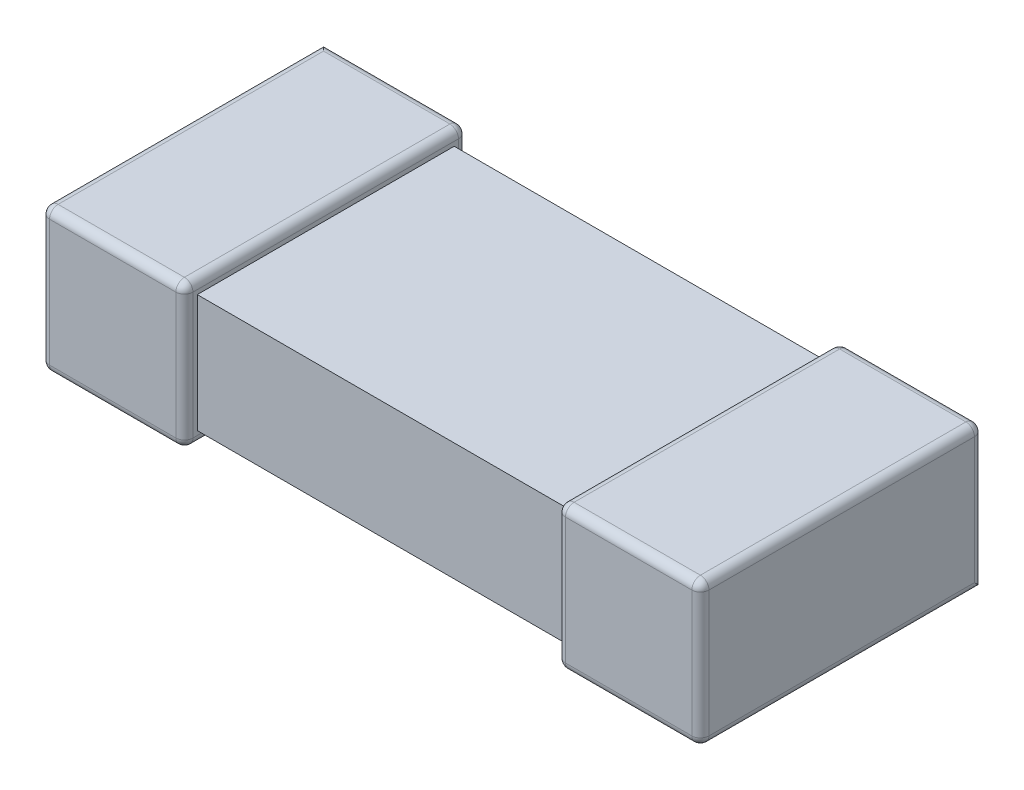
ISO-10303-21;
HEADER;
FILE_DESCRIPTION(('STEP AP214'),'2;1');
FILE_NAME('part.step','',(''),(''),'','','');
FILE_SCHEMA(('AUTOMOTIVE_DESIGN { 1 0 10303 214 1 1 1 1 }'));
ENDSEC;
DATA;
#1=APPLICATION_CONTEXT('core data for automotive mechanical design processes');
#2=APPLICATION_PROTOCOL_DEFINITION('international standard','automotive_design',2000,#1);
#3=PRODUCT_CONTEXT('',#1,'mechanical');
#4=PRODUCT('Part','Part','',(#3));
#5=PRODUCT_RELATED_PRODUCT_CATEGORY('part','',(#4));
#6=PRODUCT_DEFINITION_FORMATION('','',#4);
#7=PRODUCT_DEFINITION_CONTEXT('part definition',#1,'design');
#8=PRODUCT_DEFINITION('design','',#6,#7);
#9=PRODUCT_DEFINITION_SHAPE('','',#8);
#10=(LENGTH_UNIT() NAMED_UNIT(*) SI_UNIT(.MILLI.,.METRE.));
#11=(NAMED_UNIT(*) PLANE_ANGLE_UNIT() SI_UNIT($,.RADIAN.));
#12=(NAMED_UNIT(*) SI_UNIT($,.STERADIAN.) SOLID_ANGLE_UNIT());
#13=UNCERTAINTY_MEASURE_WITH_UNIT(LENGTH_MEASURE(1.E-05),#10,'distance_accuracy_value','');
#14=(GEOMETRIC_REPRESENTATION_CONTEXT(3) GLOBAL_UNCERTAINTY_ASSIGNED_CONTEXT((#13)) GLOBAL_UNIT_ASSIGNED_CONTEXT((#10,
#11,#12)) REPRESENTATION_CONTEXT('',''));
#15=CARTESIAN_POINT('',(0.,0.,0.));
#16=DIRECTION('',(0.,0.,1.));
#17=DIRECTION('',(1.,0.,0.));
#18=AXIS2_PLACEMENT_3D('',#15,#16,#17);
#19=CARTESIAN_POINT('',(-1.1049,0.6985,-0.762000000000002));
#20=DIRECTION('',(0.,0.,1.));
#21=DIRECTION('',(1.,0.,0.));
#22=AXIS2_PLACEMENT_3D('',#19,#20,#21);
#23=PLANE('',#22);
#24=DIRECTION('',(-1.,0.,0.));
#25=VECTOR('',#24,1.);
#26=CARTESIAN_POINT('',(-1.1049,0.,-0.762000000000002));
#27=LINE('',#26,#25);
#28=CARTESIAN_POINT('',(1.1049,0.,-0.762000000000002));
#29=VERTEX_POINT('',#28);
#30=CARTESIAN_POINT('',(-1.1049,0.,-0.762000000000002));
#31=VERTEX_POINT('',#30);
#32=EDGE_CURVE('E212',#29,#31,#27,.T.);
#33=ORIENTED_EDGE('',*,*,#32,.T.);
#34=DIRECTION('',(0.,-1.,0.));
#35=VECTOR('',#34,1.);
#36=CARTESIAN_POINT('',(-1.1049,0.6985,-0.762000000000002));
#37=LINE('',#36,#35);
#38=CARTESIAN_POINT('',(-1.1049,0.6985,-0.762000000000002));
#39=VERTEX_POINT('',#38);
#40=EDGE_CURVE('E234',#39,#31,#37,.T.);
#41=ORIENTED_EDGE('',*,*,#40,.F.);
#42=DIRECTION('',(-1.,0.,0.));
#43=VECTOR('',#42,1.);
#44=CARTESIAN_POINT('',(-1.1049,0.6985,-0.762000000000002));
#45=LINE('',#44,#43);
#46=CARTESIAN_POINT('',(1.1049,0.6985,-0.762000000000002));
#47=VERTEX_POINT('',#46);
#48=EDGE_CURVE('E976',#47,#39,#45,.T.);
#49=ORIENTED_EDGE('',*,*,#48,.F.);
#50=DIRECTION('',(0.,-1.,0.));
#51=VECTOR('',#50,1.);
#52=CARTESIAN_POINT('',(1.1049,0.6985,-0.762000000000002));
#53=LINE('',#52,#51);
#54=EDGE_CURVE('E242',#47,#29,#53,.T.);
#55=ORIENTED_EDGE('',*,*,#54,.T.);
#56=EDGE_LOOP('',(#33,#41,#49,#55));
#57=FACE_BOUND('',#56,.T.);
#58=ADVANCED_FACE('F34',(#57),#23,.F.);
#59=CARTESIAN_POINT('',(-1.1049,0.6985,0.761999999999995));
#60=DIRECTION('',(0.,0.,-1.));
#61=DIRECTION('',(-1.,0.,0.));
#62=AXIS2_PLACEMENT_3D('',#59,#60,#61);
#63=PLANE('',#62);
#64=DIRECTION('',(1.,0.,0.));
#65=VECTOR('',#64,1.);
#66=CARTESIAN_POINT('',(-1.1049,0.,0.761999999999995));
#67=LINE('',#66,#65);
#68=CARTESIAN_POINT('',(-1.1049,0.,0.761999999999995));
#69=VERTEX_POINT('',#68);
#70=CARTESIAN_POINT('',(1.1049,0.,0.761999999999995));
#71=VERTEX_POINT('',#70);
#72=EDGE_CURVE('E209',#69,#71,#67,.T.);
#73=ORIENTED_EDGE('',*,*,#72,.T.);
#74=DIRECTION('',(0.,-1.,0.));
#75=VECTOR('',#74,1.);
#76=CARTESIAN_POINT('',(1.1049,0.6985,0.761999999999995));
#77=LINE('',#76,#75);
#78=CARTESIAN_POINT('',(1.1049,0.6985,0.761999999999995));
#79=VERTEX_POINT('',#78);
#80=EDGE_CURVE('E223',#79,#71,#77,.T.);
#81=ORIENTED_EDGE('',*,*,#80,.F.);
#82=DIRECTION('',(1.,0.,0.));
#83=VECTOR('',#82,1.);
#84=CARTESIAN_POINT('',(-1.1049,0.6985,0.761999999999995));
#85=LINE('',#84,#83);
#86=CARTESIAN_POINT('',(-1.1049,0.6985,0.761999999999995));
#87=VERTEX_POINT('',#86);
#88=EDGE_CURVE('E232',#87,#79,#85,.T.);
#89=ORIENTED_EDGE('',*,*,#88,.F.);
#90=DIRECTION('',(0.,-1.,0.));
#91=VECTOR('',#90,1.);
#92=CARTESIAN_POINT('',(-1.1049,0.6985,0.761999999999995));
#93=LINE('',#92,#91);
#94=EDGE_CURVE('E226',#87,#69,#93,.T.);
#95=ORIENTED_EDGE('',*,*,#94,.T.);
#96=EDGE_LOOP('',(#73,#81,#89,#95));
#97=FACE_BOUND('',#96,.T.);
#98=ADVANCED_FACE('F221',(#97),#63,.F.);
#99=CARTESIAN_POINT('',(0.,0.6985,0.));
#100=DIRECTION('',(0.,1.,0.));
#101=DIRECTION('',(0.,0.,1.));
#102=AXIS2_PLACEMENT_3D('',#99,#100,#101);
#103=PLANE('',#102);
#104=DIRECTION('',(0.,0.,-1.));
#105=VECTOR('',#104,1.);
#106=CARTESIAN_POINT('',(1.1049,0.6985,-0.762000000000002));
#107=LINE('',#106,#105);
#108=EDGE_CURVE('E227',#79,#47,#107,.T.);
#109=ORIENTED_EDGE('',*,*,#108,.T.);
#110=ORIENTED_EDGE('',*,*,#48,.T.);
#111=DIRECTION('',(0.,0.,1.));
#112=VECTOR('',#111,1.);
#113=CARTESIAN_POINT('',(-1.1049,0.6985,-0.762000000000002));
#114=LINE('',#113,#112);
#115=EDGE_CURVE('E236',#39,#87,#114,.T.);
#116=ORIENTED_EDGE('',*,*,#115,.T.);
#117=ORIENTED_EDGE('',*,*,#88,.T.);
#118=EDGE_LOOP('',(#109,#110,#116,#117));
#119=FACE_BOUND('',#118,.T.);
#120=ADVANCED_FACE('F535',(#119),#103,.T.);
#121=CARTESIAN_POINT('',(0.,0.,0.));
#122=DIRECTION('',(0.,1.,0.));
#123=DIRECTION('',(0.,0.,1.));
#124=AXIS2_PLACEMENT_3D('',#121,#122,#123);
#125=PLANE('',#124);
#126=DIRECTION('',(0.,0.,-1.));
#127=VECTOR('',#126,1.);
#128=CARTESIAN_POINT('',(1.1049,0.,-0.762000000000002));
#129=LINE('',#128,#127);
#130=EDGE_CURVE('E206',#71,#29,#129,.T.);
#131=ORIENTED_EDGE('',*,*,#130,.F.);
#132=ORIENTED_EDGE('',*,*,#72,.F.);
#133=DIRECTION('',(0.,0.,1.));
#134=VECTOR('',#133,1.);
#135=CARTESIAN_POINT('',(-1.1049,0.,-0.762000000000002));
#136=LINE('',#135,#134);
#137=EDGE_CURVE('E228',#31,#69,#136,.T.);
#138=ORIENTED_EDGE('',*,*,#137,.F.);
#139=ORIENTED_EDGE('',*,*,#32,.F.);
#140=EDGE_LOOP('',(#131,#132,#138,#139));
#141=FACE_BOUND('',#140,.T.);
#142=ADVANCED_FACE('F208',(#141),#125,.F.);
#143=CARTESIAN_POINT('',(-1.9558,-0.0762000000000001,0.838199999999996));
#144=DIRECTION('',(0.,0.,-1.));
#145=DIRECTION('',(-1.,0.,0.));
#146=AXIS2_PLACEMENT_3D('',#143,#144,#145);
#147=PLANE('',#146);
#148=DIRECTION('',(0.,1.,0.));
#149=VECTOR('',#148,1.);
#150=CARTESIAN_POINT('',(-1.905,-0.0762000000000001,0.838199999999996));
#151=LINE('',#150,#149);
#152=CARTESIAN_POINT('',(-1.905,0.7239,0.838199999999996));
#153=VERTEX_POINT('',#152);
#154=CARTESIAN_POINT('',(-1.905,-0.0254000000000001,0.838199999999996));
#155=VERTEX_POINT('',#154);
#156=EDGE_CURVE('E271',#153,#155,#151,.F.);
#157=ORIENTED_EDGE('',*,*,#156,.T.);
#158=DIRECTION('',(1.,0.,0.));
#159=VECTOR('',#158,1.);
#160=CARTESIAN_POINT('',(-1.9558,-0.0254000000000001,0.838199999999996));
#161=LINE('',#160,#159);
#162=CARTESIAN_POINT('',(-1.1557,-0.0254000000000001,0.838199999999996));
#163=VERTEX_POINT('',#162);
#164=EDGE_CURVE('E276',#155,#163,#161,.T.);
#165=ORIENTED_EDGE('',*,*,#164,.T.);
#166=DIRECTION('',(0.,1.,0.));
#167=VECTOR('',#166,1.);
#168=CARTESIAN_POINT('',(-1.1557,0.7747,0.838199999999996));
#169=LINE('',#168,#167);
#170=CARTESIAN_POINT('',(-1.1557,0.7239,0.838199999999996));
#171=VERTEX_POINT('',#170);
#172=EDGE_CURVE('E273',#163,#171,#169,.T.);
#173=ORIENTED_EDGE('',*,*,#172,.T.);
#174=DIRECTION('',(1.,0.,0.));
#175=VECTOR('',#174,1.);
#176=CARTESIAN_POINT('',(-1.9558,0.7239,0.838199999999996));
#177=LINE('',#176,#175);
#178=EDGE_CURVE('E269',#171,#153,#177,.F.);
#179=ORIENTED_EDGE('',*,*,#178,.T.);
#180=EDGE_LOOP('',(#157,#165,#173,#179));
#181=FACE_BOUND('',#180,.T.);
#182=ADVANCED_FACE('F668',(#181),#147,.F.);
#183=CARTESIAN_POINT('',(-1.9558,0.7747,-0.838200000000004));
#184=DIRECTION('',(0.,-1.,0.));
#185=DIRECTION('',(0.,0.,-1.));
#186=AXIS2_PLACEMENT_3D('',#183,#184,#185);
#187=PLANE('',#186);
#188=DIRECTION('',(1.,0.,0.));
#189=VECTOR('',#188,1.);
#190=CARTESIAN_POINT('',(-1.9558,0.7747,0.787399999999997));
#191=LINE('',#190,#189);
#192=CARTESIAN_POINT('',(-1.905,0.7747,0.787399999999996));
#193=VERTEX_POINT('',#192);
#194=CARTESIAN_POINT('',(-1.1557,0.7747,0.787399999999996));
#195=VERTEX_POINT('',#194);
#196=EDGE_CURVE('E278',#193,#195,#191,.T.);
#197=ORIENTED_EDGE('',*,*,#196,.T.);
#198=DIRECTION('',(0.,0.,-1.));
#199=VECTOR('',#198,1.);
#200=CARTESIAN_POINT('',(-1.1557,0.7747,-0.838200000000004));
#201=LINE('',#200,#199);
#202=CARTESIAN_POINT('',(-1.1557,0.7747,-0.787400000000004));
#203=VERTEX_POINT('',#202);
#204=EDGE_CURVE('E284',#195,#203,#201,.T.);
#205=ORIENTED_EDGE('',*,*,#204,.T.);
#206=DIRECTION('',(1.,0.,0.));
#207=VECTOR('',#206,1.);
#208=CARTESIAN_POINT('',(-1.9558,0.7747,-0.787400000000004));
#209=LINE('',#208,#207);
#210=CARTESIAN_POINT('',(-1.905,0.7747,-0.787400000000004));
#211=VERTEX_POINT('',#210);
#212=EDGE_CURVE('E282',#203,#211,#209,.F.);
#213=ORIENTED_EDGE('',*,*,#212,.T.);
#214=DIRECTION('',(0.,0.,-1.));
#215=VECTOR('',#214,1.);
#216=CARTESIAN_POINT('',(-1.905,0.7747,-0.838200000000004));
#217=LINE('',#216,#215);
#218=EDGE_CURVE('E280',#211,#193,#217,.F.);
#219=ORIENTED_EDGE('',*,*,#218,.T.);
#220=EDGE_LOOP('',(#197,#205,#213,#219));
#221=FACE_BOUND('',#220,.T.);
#222=ADVANCED_FACE('F664',(#221),#187,.F.);
#223=CARTESIAN_POINT('',(-1.9558,-0.0762000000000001,-0.838200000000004));
#224=DIRECTION('',(0.,0.,1.));
#225=DIRECTION('',(1.,0.,0.));
#226=AXIS2_PLACEMENT_3D('',#223,#224,#225);
#227=PLANE('',#226);
#228=DIRECTION('',(0.,-1.,0.));
#229=VECTOR('',#228,1.);
#230=CARTESIAN_POINT('',(-1.1557,-0.0762000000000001,-0.838200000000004));
#231=LINE('',#230,#229);
#232=CARTESIAN_POINT('',(-1.1557,0.7239,-0.838200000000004));
#233=VERTEX_POINT('',#232);
#234=CARTESIAN_POINT('',(-1.1557,-0.0254000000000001,-0.838200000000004));
#235=VERTEX_POINT('',#234);
#236=EDGE_CURVE('E246',#233,#235,#231,.T.);
#237=ORIENTED_EDGE('',*,*,#236,.T.);
#238=DIRECTION('',(1.,0.,0.));
#239=VECTOR('',#238,1.);
#240=CARTESIAN_POINT('',(-1.9558,-0.0254000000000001,-0.838200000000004));
#241=LINE('',#240,#239);
#242=CARTESIAN_POINT('',(-1.9558,-0.0254000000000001,-0.838200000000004));
#243=VERTEX_POINT('',#242);
#244=EDGE_CURVE('E249',#235,#243,#241,.F.);
#245=ORIENTED_EDGE('',*,*,#244,.T.);
#246=DIRECTION('',(0.,-1.,0.));
#247=VECTOR('',#246,1.);
#248=CARTESIAN_POINT('',(-1.9558,-0.0762000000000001,-0.838200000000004));
#249=LINE('',#248,#247);
#250=CARTESIAN_POINT('',(-1.9558,0.7239,-0.838200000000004));
#251=VERTEX_POINT('',#250);
#252=EDGE_CURVE('E217',#251,#243,#249,.T.);
#253=ORIENTED_EDGE('',*,*,#252,.F.);
#254=DIRECTION('',(1.,0.,0.));
#255=VECTOR('',#254,1.);
#256=CARTESIAN_POINT('',(-1.9558,0.7239,-0.838200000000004));
#257=LINE('',#256,#255);
#258=EDGE_CURVE('E244',#251,#233,#257,.T.);
#259=ORIENTED_EDGE('',*,*,#258,.T.);
#260=EDGE_LOOP('',(#237,#245,#253,#259));
#261=FACE_BOUND('',#260,.T.);
#262=ADVANCED_FACE('F660',(#261),#227,.F.);
#263=CARTESIAN_POINT('',(-1.9558,-0.0762000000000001,-0.838200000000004));
#264=DIRECTION('',(0.,1.,0.));
#265=DIRECTION('',(0.,0.,1.));
#266=AXIS2_PLACEMENT_3D('',#263,#264,#265);
#267=PLANE('',#266);
#268=DIRECTION('',(0.,0.,1.));
#269=VECTOR('',#268,1.);
#270=CARTESIAN_POINT('',(-1.905,-0.0762000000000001,-0.838200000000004));
#271=LINE('',#270,#269);
#272=CARTESIAN_POINT('',(-1.905,-0.0762000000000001,0.787399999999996));
#273=VERTEX_POINT('',#272);
#274=CARTESIAN_POINT('',(-1.905,-0.0762000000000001,-0.787400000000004));
#275=VERTEX_POINT('',#274);
#276=EDGE_CURVE('E262',#273,#275,#271,.F.);
#277=ORIENTED_EDGE('',*,*,#276,.T.);
#278=DIRECTION('',(1.,0.,0.));
#279=VECTOR('',#278,1.);
#280=CARTESIAN_POINT('',(-1.9558,-0.0762000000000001,-0.787400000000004));
#281=LINE('',#280,#279);
#282=CARTESIAN_POINT('',(-1.1557,-0.0762000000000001,-0.787400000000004));
#283=VERTEX_POINT('',#282);
#284=EDGE_CURVE('E267',#275,#283,#281,.T.);
#285=ORIENTED_EDGE('',*,*,#284,.T.);
#286=DIRECTION('',(0.,0.,1.));
#287=VECTOR('',#286,1.);
#288=CARTESIAN_POINT('',(-1.1557,-0.0762000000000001,0.838199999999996));
#289=LINE('',#288,#287);
#290=CARTESIAN_POINT('',(-1.1557,-0.0762000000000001,0.787399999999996));
#291=VERTEX_POINT('',#290);
#292=EDGE_CURVE('E264',#283,#291,#289,.T.);
#293=ORIENTED_EDGE('',*,*,#292,.T.);
#294=DIRECTION('',(1.,0.,0.));
#295=VECTOR('',#294,1.);
#296=CARTESIAN_POINT('',(-1.9558,-0.0762000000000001,0.787399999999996));
#297=LINE('',#296,#295);
#298=EDGE_CURVE('E260',#291,#273,#297,.F.);
#299=ORIENTED_EDGE('',*,*,#298,.T.);
#300=EDGE_LOOP('',(#277,#285,#293,#299));
#301=FACE_BOUND('',#300,.T.);
#302=ADVANCED_FACE('F653',(#301),#267,.F.);
#303=CARTESIAN_POINT('',(-1.9558,0.,0.));
#304=DIRECTION('',(1.,0.,0.));
#305=DIRECTION('',(0.,0.,-1.));
#306=AXIS2_PLACEMENT_3D('',#303,#304,#305);
#307=PLANE('',#306);
#308=ORIENTED_EDGE('',*,*,#252,.T.);
#309=DIRECTION('',(0.,0.,1.));
#310=VECTOR('',#309,1.);
#311=CARTESIAN_POINT('',(-1.9558,-0.0254000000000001,0.));
#312=LINE('',#311,#310);
#313=CARTESIAN_POINT('',(-1.9558,-0.0254000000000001,0.787399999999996));
#314=VERTEX_POINT('',#313);
#315=EDGE_CURVE('E291',#243,#314,#312,.T.);
#316=ORIENTED_EDGE('',*,*,#315,.T.);
#317=DIRECTION('',(0.,1.,0.));
#318=VECTOR('',#317,1.);
#319=CARTESIAN_POINT('',(-1.9558,0.,0.787399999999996));
#320=LINE('',#319,#318);
#321=CARTESIAN_POINT('',(-1.9558,0.7239,0.787399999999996));
#322=VERTEX_POINT('',#321);
#323=EDGE_CURVE('E287',#314,#322,#320,.T.);
#324=ORIENTED_EDGE('',*,*,#323,.T.);
#325=DIRECTION('',(0.,0.,-1.));
#326=VECTOR('',#325,1.);
#327=CARTESIAN_POINT('',(-1.9558,0.7239,0.));
#328=LINE('',#327,#326);
#329=EDGE_CURVE('E289',#322,#251,#328,.T.);
#330=ORIENTED_EDGE('',*,*,#329,.T.);
#331=EDGE_LOOP('',(#308,#316,#324,#330));
#332=FACE_BOUND('',#331,.T.);
#333=ADVANCED_FACE('F650',(#332),#307,.F.);
#334=CARTESIAN_POINT('',(-1.1049,0.,0.));
#335=DIRECTION('',(1.,0.,0.));
#336=DIRECTION('',(0.,0.,-1.));
#337=AXIS2_PLACEMENT_3D('',#334,#335,#336);
#338=PLANE('',#337);
#339=DIRECTION('',(0.,0.,1.));
#340=VECTOR('',#339,1.);
#341=CARTESIAN_POINT('',(-1.1049,-0.0254000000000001,-0.838200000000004));
#342=LINE('',#341,#340);
#343=CARTESIAN_POINT('',(-1.1049,-0.0254000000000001,0.787399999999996));
#344=VERTEX_POINT('',#343);
#345=CARTESIAN_POINT('',(-1.1049,-0.0254000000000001,-0.787400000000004));
#346=VERTEX_POINT('',#345);
#347=EDGE_CURVE('E255',#344,#346,#342,.F.);
#348=ORIENTED_EDGE('',*,*,#347,.T.);
#349=DIRECTION('',(0.,-1.,0.));
#350=VECTOR('',#349,1.);
#351=CARTESIAN_POINT('',(-1.1049,0.7747,-0.787400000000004));
#352=LINE('',#351,#350);
#353=CARTESIAN_POINT('',(-1.1049,0.7239,-0.787400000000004));
#354=VERTEX_POINT('',#353);
#355=EDGE_CURVE('E257',#346,#354,#352,.F.);
#356=ORIENTED_EDGE('',*,*,#355,.T.);
#357=DIRECTION('',(0.,0.,-1.));
#358=VECTOR('',#357,1.);
#359=CARTESIAN_POINT('',(-1.1049,0.7239,0.838199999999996));
#360=LINE('',#359,#358);
#361=CARTESIAN_POINT('',(-1.1049,0.7239,0.787399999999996));
#362=VERTEX_POINT('',#361);
#363=EDGE_CURVE('E251',#354,#362,#360,.F.);
#364=ORIENTED_EDGE('',*,*,#363,.T.);
#365=DIRECTION('',(0.,1.,0.));
#366=VECTOR('',#365,1.);
#367=CARTESIAN_POINT('',(-1.1049,-0.0762000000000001,0.787399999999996));
#368=LINE('',#367,#366);
#369=EDGE_CURVE('E253',#362,#344,#368,.F.);
#370=ORIENTED_EDGE('',*,*,#369,.T.);
#371=EDGE_LOOP('',(#348,#356,#364,#370));
#372=FACE_BOUND('',#371,.T.);
#373=ORIENTED_EDGE('',*,*,#40,.T.);
#374=ORIENTED_EDGE('',*,*,#137,.T.);
#375=ORIENTED_EDGE('',*,*,#94,.F.);
#376=ORIENTED_EDGE('',*,*,#115,.F.);
#377=EDGE_LOOP('',(#373,#374,#375,#376));
#378=FACE_BOUND('',#377,.T.);
#379=ADVANCED_FACE('F649',(#372,#378),#338,.T.);
#380=CARTESIAN_POINT('',(1.9558,-0.0761999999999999,-0.838200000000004));
#381=DIRECTION('',(0.,0.,1.));
#382=DIRECTION('',(1.,0.,0.));
#383=AXIS2_PLACEMENT_3D('',#380,#381,#382);
#384=PLANE('',#383);
#385=DIRECTION('',(-1.,0.,0.));
#386=VECTOR('',#385,1.);
#387=CARTESIAN_POINT('',(1.9558,0.7239,-0.838200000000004));
#388=LINE('',#387,#386);
#389=CARTESIAN_POINT('',(1.1557,0.7239,-0.838200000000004));
#390=VERTEX_POINT('',#389);
#391=CARTESIAN_POINT('',(1.905,0.7239,-0.838200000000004));
#392=VERTEX_POINT('',#391);
#393=EDGE_CURVE('E365',#390,#392,#388,.F.);
#394=ORIENTED_EDGE('',*,*,#393,.T.);
#395=DIRECTION('',(0.,1.,0.));
#396=VECTOR('',#395,1.);
#397=CARTESIAN_POINT('',(1.905,-0.0761999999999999,-0.838200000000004));
#398=LINE('',#397,#396);
#399=CARTESIAN_POINT('',(1.905,-0.0761999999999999,-0.838200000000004));
#400=VERTEX_POINT('',#399);
#401=EDGE_CURVE('E369',#392,#400,#398,.F.);
#402=ORIENTED_EDGE('',*,*,#401,.T.);
#403=DIRECTION('',(-1.,0.,0.));
#404=VECTOR('',#403,1.);
#405=CARTESIAN_POINT('',(1.9558,-0.0761999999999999,-0.838200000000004));
#406=LINE('',#405,#404);
#407=CARTESIAN_POINT('',(1.1557,-0.0761999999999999,-0.838200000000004));
#408=VERTEX_POINT('',#407);
#409=EDGE_CURVE('E349',#400,#408,#406,.T.);
#410=ORIENTED_EDGE('',*,*,#409,.T.);
#411=DIRECTION('',(0.,1.,0.));
#412=VECTOR('',#411,1.);
#413=CARTESIAN_POINT('',(1.1557,0.7747,-0.838200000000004));
#414=LINE('',#413,#412);
#415=EDGE_CURVE('E367',#408,#390,#414,.T.);
#416=ORIENTED_EDGE('',*,*,#415,.T.);
#417=EDGE_LOOP('',(#394,#402,#410,#416));
#418=FACE_BOUND('',#417,.T.);
#419=ADVANCED_FACE('F487',(#418),#384,.F.);
#420=CARTESIAN_POINT('',(1.9558,0.7747,0.838199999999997));
#421=DIRECTION('',(0.,-1.,0.));
#422=DIRECTION('',(0.,0.,-1.));
#423=AXIS2_PLACEMENT_3D('',#420,#421,#422);
#424=PLANE('',#423);
#425=DIRECTION('',(0.,0.,1.));
#426=VECTOR('',#425,1.);
#427=CARTESIAN_POINT('',(1.905,0.7747,0.838199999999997));
#428=LINE('',#427,#426);
#429=CARTESIAN_POINT('',(1.905,0.7747,0.787399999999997));
#430=VERTEX_POINT('',#429);
#431=CARTESIAN_POINT('',(1.905,0.7747,-0.787400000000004));
#432=VERTEX_POINT('',#431);
#433=EDGE_CURVE('E384',#430,#432,#428,.F.);
#434=ORIENTED_EDGE('',*,*,#433,.T.);
#435=DIRECTION('',(-1.,0.,0.));
#436=VECTOR('',#435,1.);
#437=CARTESIAN_POINT('',(1.9558,0.7747,-0.787400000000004));
#438=LINE('',#437,#436);
#439=CARTESIAN_POINT('',(1.1557,0.7747,-0.787400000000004));
#440=VERTEX_POINT('',#439);
#441=EDGE_CURVE('E386',#432,#440,#438,.T.);
#442=ORIENTED_EDGE('',*,*,#441,.T.);
#443=DIRECTION('',(0.,0.,1.));
#444=VECTOR('',#443,1.);
#445=CARTESIAN_POINT('',(1.1557,0.7747,0.838199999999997));
#446=LINE('',#445,#444);
#447=CARTESIAN_POINT('',(1.1557,0.7747,0.787399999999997));
#448=VERTEX_POINT('',#447);
#449=EDGE_CURVE('E380',#440,#448,#446,.T.);
#450=ORIENTED_EDGE('',*,*,#449,.T.);
#451=DIRECTION('',(-1.,0.,0.));
#452=VECTOR('',#451,1.);
#453=CARTESIAN_POINT('',(1.9558,0.7747,0.787399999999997));
#454=LINE('',#453,#452);
#455=EDGE_CURVE('E382',#448,#430,#454,.F.);
#456=ORIENTED_EDGE('',*,*,#455,.T.);
#457=EDGE_LOOP('',(#434,#442,#450,#456));
#458=FACE_BOUND('',#457,.T.);
#459=ADVANCED_FACE('F464',(#458),#424,.F.);
#460=CARTESIAN_POINT('',(1.9558,-0.0761999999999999,0.838199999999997));
#461=DIRECTION('',(0.,0.,-1.));
#462=DIRECTION('',(-1.,0.,0.));
#463=AXIS2_PLACEMENT_3D('',#460,#461,#462);
#464=PLANE('',#463);
#465=DIRECTION('',(0.,-1.,0.));
#466=VECTOR('',#465,1.);
#467=CARTESIAN_POINT('',(1.905,-0.0761999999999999,0.838199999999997));
#468=LINE('',#467,#466);
#469=CARTESIAN_POINT('',(1.905,-0.0253999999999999,0.838199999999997));
#470=VERTEX_POINT('',#469);
#471=CARTESIAN_POINT('',(1.905,0.7239,0.838199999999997));
#472=VERTEX_POINT('',#471);
#473=EDGE_CURVE('E43',#470,#472,#468,.F.);
#474=ORIENTED_EDGE('',*,*,#473,.T.);
#475=DIRECTION('',(-1.,0.,0.));
#476=VECTOR('',#475,1.);
#477=CARTESIAN_POINT('',(1.9558,0.7239,0.838199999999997));
#478=LINE('',#477,#476);
#479=CARTESIAN_POINT('',(1.1557,0.7239,0.838199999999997));
#480=VERTEX_POINT('',#479);
#481=EDGE_CURVE('E11',#472,#480,#478,.T.);
#482=ORIENTED_EDGE('',*,*,#481,.T.);
#483=DIRECTION('',(0.,-1.,0.));
#484=VECTOR('',#483,1.);
#485=CARTESIAN_POINT('',(1.1557,-0.0761999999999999,0.838199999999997));
#486=LINE('',#485,#484);
#487=CARTESIAN_POINT('',(1.1557,-0.0253999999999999,0.838199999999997));
#488=VERTEX_POINT('',#487);
#489=EDGE_CURVE('E389',#480,#488,#486,.T.);
#490=ORIENTED_EDGE('',*,*,#489,.T.);
#491=DIRECTION('',(-1.,0.,0.));
#492=VECTOR('',#491,1.);
#493=CARTESIAN_POINT('',(1.9558,-0.0253999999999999,0.838199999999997));
#494=LINE('',#493,#492);
#495=EDGE_CURVE('E54',#488,#470,#494,.F.);
#496=ORIENTED_EDGE('',*,*,#495,.T.);
#497=EDGE_LOOP('',(#474,#482,#490,#496));
#498=FACE_BOUND('',#497,.T.);
#499=ADVANCED_FACE('F640',(#498),#464,.F.);
#500=CARTESIAN_POINT('',(1.9558,-0.0761999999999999,0.838199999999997));
#501=DIRECTION('',(0.,1.,0.));
#502=DIRECTION('',(0.,0.,1.));
#503=AXIS2_PLACEMENT_3D('',#500,#501,#502);
#504=PLANE('',#503);
#505=ORIENTED_EDGE('',*,*,#409,.F.);
#506=DIRECTION('',(0.,0.,-1.));
#507=VECTOR('',#506,1.);
#508=CARTESIAN_POINT('',(1.905,-0.0761999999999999,0.838199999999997));
#509=LINE('',#508,#507);
#510=CARTESIAN_POINT('',(1.905,-0.0761999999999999,0.787399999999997));
#511=VERTEX_POINT('',#510);
#512=EDGE_CURVE('E362',#400,#511,#509,.F.);
#513=ORIENTED_EDGE('',*,*,#512,.T.);
#514=DIRECTION('',(-1.,0.,0.));
#515=VECTOR('',#514,1.);
#516=CARTESIAN_POINT('',(1.9558,-0.0761999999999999,0.787399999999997));
#517=LINE('',#516,#515);
#518=CARTESIAN_POINT('',(1.1557,-0.0761999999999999,0.787399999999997));
#519=VERTEX_POINT('',#518);
#520=EDGE_CURVE('E360',#511,#519,#517,.T.);
#521=ORIENTED_EDGE('',*,*,#520,.T.);
#522=DIRECTION('',(0.,0.,-1.));
#523=VECTOR('',#522,1.);
#524=CARTESIAN_POINT('',(1.1557,-0.0761999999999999,-0.838200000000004));
#525=LINE('',#524,#523);
#526=EDGE_CURVE('E358',#519,#408,#525,.T.);
#527=ORIENTED_EDGE('',*,*,#526,.T.);
#528=EDGE_LOOP('',(#505,#513,#521,#527));
#529=FACE_BOUND('',#528,.T.);
#530=ADVANCED_FACE('F491',(#529),#504,.F.);
#531=CARTESIAN_POINT('',(1.9558,0.,0.));
#532=DIRECTION('',(-1.,0.,0.));
#533=DIRECTION('',(0.,0.,1.));
#534=AXIS2_PLACEMENT_3D('',#531,#532,#533);
#535=PLANE('',#534);
#536=DIRECTION('',(0.,-1.,0.));
#537=VECTOR('',#536,1.);
#538=CARTESIAN_POINT('',(1.9558,0.,0.787399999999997));
#539=LINE('',#538,#537);
#540=CARTESIAN_POINT('',(1.9558,0.7239,0.787399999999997));
#541=VERTEX_POINT('',#540);
#542=CARTESIAN_POINT('',(1.9558,-0.0253999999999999,0.787399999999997));
#543=VERTEX_POINT('',#542);
#544=EDGE_CURVE('E293',#541,#543,#539,.T.);
#545=ORIENTED_EDGE('',*,*,#544,.T.);
#546=DIRECTION('',(0.,0.,-1.));
#547=VECTOR('',#546,1.);
#548=CARTESIAN_POINT('',(1.9558,-0.0253999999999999,0.));
#549=LINE('',#548,#547);
#550=CARTESIAN_POINT('',(1.9558,-0.0253999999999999,-0.787400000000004));
#551=VERTEX_POINT('',#550);
#552=EDGE_CURVE('E355',#543,#551,#549,.T.);
#553=ORIENTED_EDGE('',*,*,#552,.T.);
#554=DIRECTION('',(0.,1.,0.));
#555=VECTOR('',#554,1.);
#556=CARTESIAN_POINT('',(1.9558,0.,-0.787400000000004));
#557=LINE('',#556,#555);
#558=CARTESIAN_POINT('',(1.9558,0.7239,-0.787400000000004));
#559=VERTEX_POINT('',#558);
#560=EDGE_CURVE('E353',#551,#559,#557,.T.);
#561=ORIENTED_EDGE('',*,*,#560,.T.);
#562=DIRECTION('',(0.,0.,1.));
#563=VECTOR('',#562,1.);
#564=CARTESIAN_POINT('',(1.9558,0.7239,0.));
#565=LINE('',#564,#563);
#566=EDGE_CURVE('E351',#559,#541,#565,.T.);
#567=ORIENTED_EDGE('',*,*,#566,.T.);
#568=EDGE_LOOP('',(#545,#553,#561,#567));
#569=FACE_BOUND('',#568,.T.);
#570=ADVANCED_FACE('F632',(#569),#535,.F.);
#571=CARTESIAN_POINT('',(1.1049,0.,0.));
#572=DIRECTION('',(-1.,0.,0.));
#573=DIRECTION('',(0.,0.,1.));
#574=AXIS2_PLACEMENT_3D('',#571,#572,#573);
#575=PLANE('',#574);
#576=DIRECTION('',(0.,0.,1.));
#577=VECTOR('',#576,1.);
#578=CARTESIAN_POINT('',(1.1049,0.7239,-0.838200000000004));
#579=LINE('',#578,#577);
#580=CARTESIAN_POINT('',(1.1049,0.7239,0.787399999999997));
#581=VERTEX_POINT('',#580);
#582=CARTESIAN_POINT('',(1.1049,0.7239,-0.787400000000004));
#583=VERTEX_POINT('',#582);
#584=EDGE_CURVE('E371',#581,#583,#579,.F.);
#585=ORIENTED_EDGE('',*,*,#584,.T.);
#586=DIRECTION('',(0.,1.,0.));
#587=VECTOR('',#586,1.);
#588=CARTESIAN_POINT('',(1.1049,-0.0761999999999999,-0.787400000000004));
#589=LINE('',#588,#587);
#590=CARTESIAN_POINT('',(1.1049,-0.0253999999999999,-0.787400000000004));
#591=VERTEX_POINT('',#590);
#592=EDGE_CURVE('E377',#583,#591,#589,.F.);
#593=ORIENTED_EDGE('',*,*,#592,.T.);
#594=DIRECTION('',(0.,0.,-1.));
#595=VECTOR('',#594,1.);
#596=CARTESIAN_POINT('',(1.1049,-0.0253999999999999,0.838199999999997));
#597=LINE('',#596,#595);
#598=CARTESIAN_POINT('',(1.1049,-0.0253999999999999,0.787399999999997));
#599=VERTEX_POINT('',#598);
#600=EDGE_CURVE('E375',#591,#599,#597,.F.);
#601=ORIENTED_EDGE('',*,*,#600,.T.);
#602=DIRECTION('',(0.,-1.,0.));
#603=VECTOR('',#602,1.);
#604=CARTESIAN_POINT('',(1.1049,0.7747,0.787399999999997));
#605=LINE('',#604,#603);
#606=EDGE_CURVE('E373',#599,#581,#605,.F.);
#607=ORIENTED_EDGE('',*,*,#606,.T.);
#608=EDGE_LOOP('',(#585,#593,#601,#607));
#609=FACE_BOUND('',#608,.T.);
#610=ORIENTED_EDGE('',*,*,#80,.T.);
#611=ORIENTED_EDGE('',*,*,#130,.T.);
#612=ORIENTED_EDGE('',*,*,#54,.F.);
#613=ORIENTED_EDGE('',*,*,#108,.F.);
#614=EDGE_LOOP('',(#610,#611,#612,#613));
#615=FACE_BOUND('',#614,.T.);
#616=ADVANCED_FACE('F230',(#609,#615),#575,.T.);
#617=CARTESIAN_POINT('',(-1.905,0.,0.787399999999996));
#618=DIRECTION('',(0.,1.,0.));
#619=DIRECTION('',(0.,0.,1.));
#620=AXIS2_PLACEMENT_3D('',#617,#618,#619);
#621=CYLINDRICAL_SURFACE('',#620,0.0508);
#622=CARTESIAN_POINT('',(-1.905,-0.0254000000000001,0.787399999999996));
#623=DIRECTION('',(0.,-1.,0.));
#624=DIRECTION('',(0.,0.,-1.));
#625=AXIS2_PLACEMENT_3D('',#622,#623,#624);
#626=CIRCLE('',#625,0.0508);
#627=EDGE_CURVE('E340',#155,#314,#626,.T.);
#628=ORIENTED_EDGE('',*,*,#627,.F.);
#629=ORIENTED_EDGE('',*,*,#156,.F.);
#630=CARTESIAN_POINT('',(-1.905,0.7239,0.787399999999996));
#631=DIRECTION('',(0.,1.,0.));
#632=DIRECTION('',(0.,0.,1.));
#633=AXIS2_PLACEMENT_3D('',#630,#631,#632);
#634=CIRCLE('',#633,0.0508);
#635=EDGE_CURVE('E343',#322,#153,#634,.T.);
#636=ORIENTED_EDGE('',*,*,#635,.F.);
#637=ORIENTED_EDGE('',*,*,#323,.F.);
#638=EDGE_LOOP('',(#628,#629,#636,#637));
#639=FACE_BOUND('',#638,.T.);
#640=ADVANCED_FACE('F602',(#639),#621,.T.);
#641=CARTESIAN_POINT('',(-1.9558,0.7239,0.787399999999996));
#642=DIRECTION('',(1.,0.,0.));
#643=DIRECTION('',(0.,0.,-1.));
#644=AXIS2_PLACEMENT_3D('',#641,#642,#643);
#645=CYLINDRICAL_SURFACE('',#644,0.0508);
#646=CARTESIAN_POINT('',(-1.905,0.7239,0.787399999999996));
#647=DIRECTION('',(-1.,0.,0.));
#648=DIRECTION('',(0.,0.,1.));
#649=AXIS2_PLACEMENT_3D('',#646,#647,#648);
#650=CIRCLE('',#649,0.0508);
#651=EDGE_CURVE('E346',#153,#193,#650,.T.);
#652=ORIENTED_EDGE('',*,*,#651,.F.);
#653=ORIENTED_EDGE('',*,*,#178,.F.);
#654=CARTESIAN_POINT('',(-1.1557,0.7239,0.787399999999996));
#655=DIRECTION('',(1.,0.,0.));
#656=DIRECTION('',(0.,0.,-1.));
#657=AXIS2_PLACEMENT_3D('',#654,#655,#656);
#658=CIRCLE('',#657,0.0508);
#659=EDGE_CURVE('E332',#195,#171,#658,.T.);
#660=ORIENTED_EDGE('',*,*,#659,.F.);
#661=ORIENTED_EDGE('',*,*,#196,.F.);
#662=EDGE_LOOP('',(#652,#653,#660,#661));
#663=FACE_BOUND('',#662,.T.);
#664=ADVANCED_FACE('F598',(#663),#645,.T.);
#665=CARTESIAN_POINT('',(-1.905,0.7239,0.787399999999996));
#666=DIRECTION('',(0.,0.,1.));
#667=DIRECTION('',(1.,0.,0.));
#668=AXIS2_PLACEMENT_3D('',#665,#666,#667);
#669=SPHERICAL_SURFACE('',#668,0.0508);
#670=ORIENTED_EDGE('',*,*,#635,.T.);
#671=ORIENTED_EDGE('',*,*,#651,.T.);
#672=CARTESIAN_POINT('',(-1.905,0.7239,0.787399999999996));
#673=DIRECTION('',(0.,0.,1.));
#674=DIRECTION('',(1.,0.,0.));
#675=AXIS2_PLACEMENT_3D('',#672,#673,#674);
#676=CIRCLE('',#675,0.0508);
#677=EDGE_CURVE('E329',#322,#193,#676,.F.);
#678=ORIENTED_EDGE('',*,*,#677,.F.);
#679=EDGE_LOOP('',(#670,#671,#678));
#680=FACE_BOUND('',#679,.T.);
#681=ADVANCED_FACE('F594',(#680),#669,.T.);
#682=CARTESIAN_POINT('',(-1.905,-0.0254000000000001,0.787399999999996));
#683=DIRECTION('',(0.,0.,1.));
#684=DIRECTION('',(1.,0.,0.));
#685=AXIS2_PLACEMENT_3D('',#682,#683,#684);
#686=SPHERICAL_SURFACE('',#685,0.0508);
#687=CARTESIAN_POINT('',(-1.905,-0.0254000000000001,0.787399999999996));
#688=DIRECTION('',(0.,0.,1.));
#689=DIRECTION('',(1.,0.,0.));
#690=AXIS2_PLACEMENT_3D('',#687,#688,#689);
#691=CIRCLE('',#690,0.0508);
#692=EDGE_CURVE('E326',#273,#314,#691,.F.);
#693=ORIENTED_EDGE('',*,*,#692,.F.);
#694=CARTESIAN_POINT('',(-1.905,-0.0254000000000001,0.787399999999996));
#695=DIRECTION('',(-1.,0.,0.));
#696=DIRECTION('',(0.,0.,1.));
#697=AXIS2_PLACEMENT_3D('',#694,#695,#696);
#698=CIRCLE('',#697,0.0508);
#699=EDGE_CURVE('E337',#155,#273,#698,.F.);
#700=ORIENTED_EDGE('',*,*,#699,.F.);
#701=ORIENTED_EDGE('',*,*,#627,.T.);
#702=EDGE_LOOP('',(#693,#700,#701));
#703=FACE_BOUND('',#702,.T.);
#704=ADVANCED_FACE('F590',(#703),#686,.T.);
#705=CARTESIAN_POINT('',(-1.9558,-0.0254000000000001,0.787399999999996));
#706=DIRECTION('',(1.,0.,0.));
#707=DIRECTION('',(0.,0.,-1.));
#708=AXIS2_PLACEMENT_3D('',#705,#706,#707);
#709=CYLINDRICAL_SURFACE('',#708,0.0508);
#710=ORIENTED_EDGE('',*,*,#699,.T.);
#711=ORIENTED_EDGE('',*,*,#298,.F.);
#712=CARTESIAN_POINT('',(-1.1557,-0.0254000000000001,0.787399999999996));
#713=DIRECTION('',(1.,0.,0.));
#714=DIRECTION('',(0.,0.,-1.));
#715=AXIS2_PLACEMENT_3D('',#712,#713,#714);
#716=CIRCLE('',#715,0.0508);
#717=EDGE_CURVE('E323',#163,#291,#716,.T.);
#718=ORIENTED_EDGE('',*,*,#717,.F.);
#719=ORIENTED_EDGE('',*,*,#164,.F.);
#720=EDGE_LOOP('',(#710,#711,#718,#719));
#721=FACE_BOUND('',#720,.T.);
#722=ADVANCED_FACE('F586',(#721),#709,.T.);
#723=CARTESIAN_POINT('',(-1.1557,-0.0762000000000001,0.787399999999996));
#724=DIRECTION('',(0.,-1.,0.));
#725=DIRECTION('',(0.,0.,-1.));
#726=AXIS2_PLACEMENT_3D('',#723,#724,#725);
#727=CYLINDRICAL_SURFACE('',#726,0.0508);
#728=CARTESIAN_POINT('',(-1.1557,0.7239,0.787399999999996));
#729=DIRECTION('',(0.,1.,0.));
#730=DIRECTION('',(0.,0.,1.));
#731=AXIS2_PLACEMENT_3D('',#728,#729,#730);
#732=CIRCLE('',#731,0.0508);
#733=EDGE_CURVE('E334',#171,#362,#732,.T.);
#734=ORIENTED_EDGE('',*,*,#733,.F.);
#735=ORIENTED_EDGE('',*,*,#172,.F.);
#736=CARTESIAN_POINT('',(-1.1557,-0.0254000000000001,0.787399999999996));
#737=DIRECTION('',(0.,-1.,0.));
#738=DIRECTION('',(0.,0.,-1.));
#739=AXIS2_PLACEMENT_3D('',#736,#737,#738);
#740=CIRCLE('',#739,0.0508);
#741=EDGE_CURVE('E320',#344,#163,#740,.T.);
#742=ORIENTED_EDGE('',*,*,#741,.F.);
#743=ORIENTED_EDGE('',*,*,#369,.F.);
#744=EDGE_LOOP('',(#734,#735,#742,#743));
#745=FACE_BOUND('',#744,.T.);
#746=ADVANCED_FACE('F582',(#745),#727,.T.);
#747=CARTESIAN_POINT('',(-1.1557,0.7239,0.787399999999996));
#748=DIRECTION('',(0.,0.,1.));
#749=DIRECTION('',(1.,0.,0.));
#750=AXIS2_PLACEMENT_3D('',#747,#748,#749);
#751=SPHERICAL_SURFACE('',#750,0.0508);
#752=ORIENTED_EDGE('',*,*,#659,.T.);
#753=ORIENTED_EDGE('',*,*,#733,.T.);
#754=CARTESIAN_POINT('',(-1.1557,0.7239,0.787399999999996));
#755=DIRECTION('',(0.,0.,1.));
#756=DIRECTION('',(0.,-1.,0.));
#757=AXIS2_PLACEMENT_3D('',#754,#755,#756);
#758=CIRCLE('',#757,0.0508);
#759=EDGE_CURVE('E317',#195,#362,#758,.F.);
#760=ORIENTED_EDGE('',*,*,#759,.F.);
#761=EDGE_LOOP('',(#752,#753,#760));
#762=FACE_BOUND('',#761,.T.);
#763=ADVANCED_FACE('F578',(#762),#751,.T.);
#764=CARTESIAN_POINT('',(-1.905,0.7239,0.));
#765=DIRECTION('',(0.,0.,-1.));
#766=DIRECTION('',(-1.,0.,0.));
#767=AXIS2_PLACEMENT_3D('',#764,#765,#766);
#768=CYLINDRICAL_SURFACE('',#767,0.0508);
#769=ORIENTED_EDGE('',*,*,#677,.T.);
#770=ORIENTED_EDGE('',*,*,#218,.F.);
#771=CARTESIAN_POINT('',(-1.905,0.7239,-0.787400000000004));
#772=DIRECTION('',(0.707106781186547,0.,-0.707106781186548));
#773=DIRECTION('',(-0.707106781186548,0.,-0.707106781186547));
#774=AXIS2_PLACEMENT_3D('',#771,#772,#773);
#775=ELLIPSE('',#774,0.0718420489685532,0.0508);
#776=EDGE_CURVE('E314',#251,#211,#775,.T.);
#777=ORIENTED_EDGE('',*,*,#776,.F.);
#778=ORIENTED_EDGE('',*,*,#329,.F.);
#779=EDGE_LOOP('',(#769,#770,#777,#778));
#780=FACE_BOUND('',#779,.T.);
#781=ADVANCED_FACE('F574',(#780),#768,.T.);
#782=CARTESIAN_POINT('',(-1.905,-0.0254000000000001,0.));
#783=DIRECTION('',(0.,0.,1.));
#784=DIRECTION('',(1.,0.,0.));
#785=AXIS2_PLACEMENT_3D('',#782,#783,#784);
#786=CYLINDRICAL_SURFACE('',#785,0.0508);
#787=ORIENTED_EDGE('',*,*,#692,.T.);
#788=ORIENTED_EDGE('',*,*,#315,.F.);
#789=CARTESIAN_POINT('',(-1.905,-0.0254000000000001,-0.787400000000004));
#790=DIRECTION('',(0.707106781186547,0.,-0.707106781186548));
#791=DIRECTION('',(0.707106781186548,0.,0.707106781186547));
#792=AXIS2_PLACEMENT_3D('',#789,#790,#791);
#793=ELLIPSE('',#792,0.0718420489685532,0.0508);
#794=EDGE_CURVE('E311',#275,#243,#793,.T.);
#795=ORIENTED_EDGE('',*,*,#794,.F.);
#796=ORIENTED_EDGE('',*,*,#276,.F.);
#797=EDGE_LOOP('',(#787,#788,#795,#796));
#798=FACE_BOUND('',#797,.T.);
#799=ADVANCED_FACE('F570',(#798),#786,.T.);
#800=CARTESIAN_POINT('',(-1.1557,-0.0254000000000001,0.787399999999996));
#801=DIRECTION('',(0.,0.,1.));
#802=DIRECTION('',(1.,0.,0.));
#803=AXIS2_PLACEMENT_3D('',#800,#801,#802);
#804=SPHERICAL_SURFACE('',#803,0.0508);
#805=ORIENTED_EDGE('',*,*,#741,.T.);
#806=ORIENTED_EDGE('',*,*,#717,.T.);
#807=CARTESIAN_POINT('',(-1.1557,-0.0254000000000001,0.787399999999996));
#808=DIRECTION('',(0.,0.,1.));
#809=DIRECTION('',(1.,0.,0.));
#810=AXIS2_PLACEMENT_3D('',#807,#808,#809);
#811=CIRCLE('',#810,0.0508);
#812=EDGE_CURVE('E309',#344,#291,#811,.F.);
#813=ORIENTED_EDGE('',*,*,#812,.F.);
#814=EDGE_LOOP('',(#805,#806,#813));
#815=FACE_BOUND('',#814,.T.);
#816=ADVANCED_FACE('F566',(#815),#804,.T.);
#817=CARTESIAN_POINT('',(-1.1557,0.7239,-0.838200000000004));
#818=DIRECTION('',(0.,0.,1.));
#819=DIRECTION('',(1.,0.,0.));
#820=AXIS2_PLACEMENT_3D('',#817,#818,#819);
#821=CYLINDRICAL_SURFACE('',#820,0.0508);
#822=ORIENTED_EDGE('',*,*,#759,.T.);
#823=ORIENTED_EDGE('',*,*,#363,.F.);
#824=CARTESIAN_POINT('',(-1.1557,0.7239,-0.787400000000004));
#825=DIRECTION('',(0.,0.,-1.));
#826=DIRECTION('',(-1.,0.,0.));
#827=AXIS2_PLACEMENT_3D('',#824,#825,#826);
#828=CIRCLE('',#827,0.0508);
#829=EDGE_CURVE('E306',#203,#354,#828,.T.);
#830=ORIENTED_EDGE('',*,*,#829,.F.);
#831=ORIENTED_EDGE('',*,*,#204,.F.);
#832=EDGE_LOOP('',(#822,#823,#830,#831));
#833=FACE_BOUND('',#832,.T.);
#834=ADVANCED_FACE('F562',(#833),#821,.T.);
#835=CARTESIAN_POINT('',(-1.9558,0.7239,-0.787400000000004));
#836=DIRECTION('',(1.,0.,0.));
#837=DIRECTION('',(0.,0.,-1.));
#838=AXIS2_PLACEMENT_3D('',#835,#836,#837);
#839=CYLINDRICAL_SURFACE('',#838,0.0508);
#840=ORIENTED_EDGE('',*,*,#776,.T.);
#841=ORIENTED_EDGE('',*,*,#212,.F.);
#842=CARTESIAN_POINT('',(-1.1557,0.7239,-0.787400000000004));
#843=DIRECTION('',(1.,0.,0.));
#844=DIRECTION('',(0.,0.,-1.));
#845=AXIS2_PLACEMENT_3D('',#842,#843,#844);
#846=CIRCLE('',#845,0.0508);
#847=EDGE_CURVE('E304',#233,#203,#846,.T.);
#848=ORIENTED_EDGE('',*,*,#847,.F.);
#849=ORIENTED_EDGE('',*,*,#258,.F.);
#850=EDGE_LOOP('',(#840,#841,#848,#849));
#851=FACE_BOUND('',#850,.T.);
#852=ADVANCED_FACE('F558',(#851),#839,.T.);
#853=CARTESIAN_POINT('',(-1.9558,-0.0254000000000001,-0.787400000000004));
#854=DIRECTION('',(1.,0.,0.));
#855=DIRECTION('',(0.,0.,-1.));
#856=AXIS2_PLACEMENT_3D('',#853,#854,#855);
#857=CYLINDRICAL_SURFACE('',#856,0.0508);
#858=ORIENTED_EDGE('',*,*,#794,.T.);
#859=ORIENTED_EDGE('',*,*,#244,.F.);
#860=CARTESIAN_POINT('',(-1.1557,-0.0254000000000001,-0.787400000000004));
#861=DIRECTION('',(1.,0.,0.));
#862=DIRECTION('',(0.,0.,-1.));
#863=AXIS2_PLACEMENT_3D('',#860,#861,#862);
#864=CIRCLE('',#863,0.0508);
#865=EDGE_CURVE('E301',#283,#235,#864,.T.);
#866=ORIENTED_EDGE('',*,*,#865,.F.);
#867=ORIENTED_EDGE('',*,*,#284,.F.);
#868=EDGE_LOOP('',(#858,#859,#866,#867));
#869=FACE_BOUND('',#868,.T.);
#870=ADVANCED_FACE('F554',(#869),#857,.T.);
#871=CARTESIAN_POINT('',(-1.1557,-0.0254000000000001,-0.838200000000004));
#872=DIRECTION('',(0.,0.,-1.));
#873=DIRECTION('',(-1.,0.,0.));
#874=AXIS2_PLACEMENT_3D('',#871,#872,#873);
#875=CYLINDRICAL_SURFACE('',#874,0.0508);
#876=ORIENTED_EDGE('',*,*,#812,.T.);
#877=ORIENTED_EDGE('',*,*,#292,.F.);
#878=CARTESIAN_POINT('',(-1.1557,-0.0254000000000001,-0.787400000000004));
#879=DIRECTION('',(0.,0.,-1.));
#880=DIRECTION('',(-1.,0.,0.));
#881=AXIS2_PLACEMENT_3D('',#878,#879,#880);
#882=CIRCLE('',#881,0.0508);
#883=EDGE_CURVE('E298',#346,#283,#882,.T.);
#884=ORIENTED_EDGE('',*,*,#883,.F.);
#885=ORIENTED_EDGE('',*,*,#347,.F.);
#886=EDGE_LOOP('',(#876,#877,#884,#885));
#887=FACE_BOUND('',#886,.T.);
#888=ADVANCED_FACE('F550',(#887),#875,.T.);
#889=CARTESIAN_POINT('',(-1.1557,0.7239,-0.787400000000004));
#890=DIRECTION('',(0.,0.,1.));
#891=DIRECTION('',(1.,0.,0.));
#892=AXIS2_PLACEMENT_3D('',#889,#890,#891);
#893=SPHERICAL_SURFACE('',#892,0.0508);
#894=ORIENTED_EDGE('',*,*,#847,.T.);
#895=ORIENTED_EDGE('',*,*,#829,.T.);
#896=CARTESIAN_POINT('',(-1.1557,0.7239,-0.787400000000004));
#897=DIRECTION('',(0.,1.,0.));
#898=DIRECTION('',(0.,0.,1.));
#899=AXIS2_PLACEMENT_3D('',#896,#897,#898);
#900=CIRCLE('',#899,0.0508);
#901=EDGE_CURVE('E296',#233,#354,#900,.F.);
#902=ORIENTED_EDGE('',*,*,#901,.F.);
#903=EDGE_LOOP('',(#894,#895,#902));
#904=FACE_BOUND('',#903,.T.);
#905=ADVANCED_FACE('F546',(#904),#893,.T.);
#906=CARTESIAN_POINT('',(-1.1557,-0.0254000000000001,-0.787400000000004));
#907=DIRECTION('',(0.,0.,1.));
#908=DIRECTION('',(1.,0.,0.));
#909=AXIS2_PLACEMENT_3D('',#906,#907,#908);
#910=SPHERICAL_SURFACE('',#909,0.0508);
#911=ORIENTED_EDGE('',*,*,#883,.T.);
#912=ORIENTED_EDGE('',*,*,#865,.T.);
#913=CARTESIAN_POINT('',(-1.1557,-0.0254000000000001,-0.787400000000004));
#914=DIRECTION('',(0.,-1.,0.));
#915=DIRECTION('',(0.,0.,-1.));
#916=AXIS2_PLACEMENT_3D('',#913,#914,#915);
#917=CIRCLE('',#916,0.0508);
#918=EDGE_CURVE('E294',#346,#235,#917,.F.);
#919=ORIENTED_EDGE('',*,*,#918,.F.);
#920=EDGE_LOOP('',(#911,#912,#919));
#921=FACE_BOUND('',#920,.T.);
#922=ADVANCED_FACE('F542',(#921),#910,.T.);
#923=CARTESIAN_POINT('',(-1.1557,-0.0762000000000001,-0.787400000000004));
#924=DIRECTION('',(0.,1.,0.));
#925=DIRECTION('',(0.,0.,1.));
#926=AXIS2_PLACEMENT_3D('',#923,#924,#925);
#927=CYLINDRICAL_SURFACE('',#926,0.0508);
#928=ORIENTED_EDGE('',*,*,#901,.T.);
#929=ORIENTED_EDGE('',*,*,#355,.F.);
#930=ORIENTED_EDGE('',*,*,#918,.T.);
#931=ORIENTED_EDGE('',*,*,#236,.F.);
#932=EDGE_LOOP('',(#928,#929,#930,#931));
#933=FACE_BOUND('',#932,.T.);
#934=ADVANCED_FACE('F539',(#933),#927,.T.);
#935=CARTESIAN_POINT('',(1.1557,0.7239,0.787399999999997));
#936=DIRECTION('',(0.,0.,1.));
#937=DIRECTION('',(1.,0.,0.));
#938=AXIS2_PLACEMENT_3D('',#935,#936,#937);
#939=SPHERICAL_SURFACE('',#938,0.0508);
#940=CARTESIAN_POINT('',(1.1557,0.7239,0.787399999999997));
#941=DIRECTION('',(-1.,0.,0.));
#942=DIRECTION('',(0.,0.,1.));
#943=AXIS2_PLACEMENT_3D('',#940,#941,#942);
#944=CIRCLE('',#943,0.0508);
#945=EDGE_CURVE('E438',#448,#480,#944,.F.);
#946=ORIENTED_EDGE('',*,*,#945,.F.);
#947=CARTESIAN_POINT('',(1.1557,0.7239,0.787399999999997));
#948=DIRECTION('',(0.,0.,1.));
#949=DIRECTION('',(1.,0.,0.));
#950=AXIS2_PLACEMENT_3D('',#947,#948,#949);
#951=CIRCLE('',#950,0.0508);
#952=EDGE_CURVE('E38',#581,#448,#951,.F.);
#953=ORIENTED_EDGE('',*,*,#952,.F.);
#954=CARTESIAN_POINT('',(1.1557,0.7239,0.787399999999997));
#955=DIRECTION('',(0.,1.,0.));
#956=DIRECTION('',(0.,0.,1.));
#957=AXIS2_PLACEMENT_3D('',#954,#955,#956);
#958=CIRCLE('',#957,0.0508);
#959=EDGE_CURVE('E441',#480,#581,#958,.F.);
#960=ORIENTED_EDGE('',*,*,#959,.F.);
#961=EDGE_LOOP('',(#946,#953,#960));
#962=FACE_BOUND('',#961,.T.);
#963=ADVANCED_FACE('F36',(#962),#939,.T.);
#964=CARTESIAN_POINT('',(1.1557,0.7239,0.838199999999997));
#965=DIRECTION('',(0.,0.,-1.));
#966=DIRECTION('',(-1.,0.,0.));
#967=AXIS2_PLACEMENT_3D('',#964,#965,#966);
#968=CYLINDRICAL_SURFACE('',#967,0.0508);
#969=ORIENTED_EDGE('',*,*,#952,.T.);
#970=ORIENTED_EDGE('',*,*,#449,.F.);
#971=CARTESIAN_POINT('',(1.1557,0.7239,-0.787400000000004));
#972=DIRECTION('',(0.,0.,-1.));
#973=DIRECTION('',(0.,1.,0.));
#974=AXIS2_PLACEMENT_3D('',#971,#972,#973);
#975=CIRCLE('',#974,0.0508);
#976=EDGE_CURVE('E435',#583,#440,#975,.T.);
#977=ORIENTED_EDGE('',*,*,#976,.F.);
#978=ORIENTED_EDGE('',*,*,#584,.F.);
#979=EDGE_LOOP('',(#969,#970,#977,#978));
#980=FACE_BOUND('',#979,.T.);
#981=ADVANCED_FACE('F454',(#980),#968,.T.);
#982=CARTESIAN_POINT('',(1.1557,-0.0761999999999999,-0.787400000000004));
#983=DIRECTION('',(0.,-1.,0.));
#984=DIRECTION('',(0.,0.,-1.));
#985=AXIS2_PLACEMENT_3D('',#982,#983,#984);
#986=CYLINDRICAL_SURFACE('',#985,0.0508);
#987=CARTESIAN_POINT('',(1.1557,0.7239,-0.787400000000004));
#988=DIRECTION('',(0.,1.,0.));
#989=DIRECTION('',(0.,0.,1.));
#990=AXIS2_PLACEMENT_3D('',#987,#988,#989);
#991=CIRCLE('',#990,0.0508);
#992=EDGE_CURVE('E432',#390,#583,#991,.T.);
#993=ORIENTED_EDGE('',*,*,#992,.F.);
#994=ORIENTED_EDGE('',*,*,#415,.F.);
#995=CARTESIAN_POINT('',(1.1557,-0.0253999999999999,-0.787400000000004));
#996=DIRECTION('',(0.,-0.707106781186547,0.707106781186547));
#997=DIRECTION('',(0.,0.707106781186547,0.707106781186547));
#998=AXIS2_PLACEMENT_3D('',#995,#996,#997);
#999=ELLIPSE('',#998,0.0718420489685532,0.0508);
#1000=EDGE_CURVE('E443',#591,#408,#999,.T.);
#1001=ORIENTED_EDGE('',*,*,#1000,.F.);
#1002=ORIENTED_EDGE('',*,*,#592,.F.);
#1003=EDGE_LOOP('',(#993,#994,#1001,#1002));
#1004=FACE_BOUND('',#1003,.T.);
#1005=ADVANCED_FACE('F517',(#1004),#986,.T.);
#1006=CARTESIAN_POINT('',(1.1557,-0.0253999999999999,0.838199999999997));
#1007=DIRECTION('',(0.,0.,1.));
#1008=DIRECTION('',(1.,0.,0.));
#1009=AXIS2_PLACEMENT_3D('',#1006,#1007,#1008);
#1010=CYLINDRICAL_SURFACE('',#1009,0.0508);
#1011=ORIENTED_EDGE('',*,*,#1000,.T.);
#1012=ORIENTED_EDGE('',*,*,#526,.F.);
#1013=CARTESIAN_POINT('',(1.1557,-0.0253999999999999,0.787399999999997));
#1014=DIRECTION('',(0.,0.,1.));
#1015=DIRECTION('',(1.,0.,0.));
#1016=AXIS2_PLACEMENT_3D('',#1013,#1014,#1015);
#1017=CIRCLE('',#1016,0.0508);
#1018=EDGE_CURVE('E429',#599,#519,#1017,.T.);
#1019=ORIENTED_EDGE('',*,*,#1018,.F.);
#1020=ORIENTED_EDGE('',*,*,#600,.F.);
#1021=EDGE_LOOP('',(#1011,#1012,#1019,#1020));
#1022=FACE_BOUND('',#1021,.T.);
#1023=ADVANCED_FACE('F506',(#1022),#1010,.T.);
#1024=CARTESIAN_POINT('',(1.1557,-0.0761999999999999,0.787399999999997));
#1025=DIRECTION('',(0.,1.,0.));
#1026=DIRECTION('',(0.,0.,1.));
#1027=AXIS2_PLACEMENT_3D('',#1024,#1025,#1026);
#1028=CYLINDRICAL_SURFACE('',#1027,0.0508);
#1029=ORIENTED_EDGE('',*,*,#959,.T.);
#1030=ORIENTED_EDGE('',*,*,#606,.F.);
#1031=CARTESIAN_POINT('',(1.1557,-0.0253999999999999,0.787399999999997));
#1032=DIRECTION('',(0.,-1.,0.));
#1033=DIRECTION('',(0.,0.,-1.));
#1034=AXIS2_PLACEMENT_3D('',#1031,#1032,#1033);
#1035=CIRCLE('',#1034,0.0508);
#1036=EDGE_CURVE('E426',#488,#599,#1035,.T.);
#1037=ORIENTED_EDGE('',*,*,#1036,.F.);
#1038=ORIENTED_EDGE('',*,*,#489,.F.);
#1039=EDGE_LOOP('',(#1029,#1030,#1037,#1038));
#1040=FACE_BOUND('',#1039,.T.);
#1041=ADVANCED_FACE('F512',(#1040),#1028,.T.);
#1042=CARTESIAN_POINT('',(1.9558,0.7239,0.787399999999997));
#1043=DIRECTION('',(-1.,0.,0.));
#1044=DIRECTION('',(0.,0.,1.));
#1045=AXIS2_PLACEMENT_3D('',#1042,#1043,#1044);
#1046=CYLINDRICAL_SURFACE('',#1045,0.0508);
#1047=ORIENTED_EDGE('',*,*,#945,.T.);
#1048=ORIENTED_EDGE('',*,*,#481,.F.);
#1049=CARTESIAN_POINT('',(1.905,0.7239,0.787399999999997));
#1050=DIRECTION('',(1.,0.,0.));
#1051=DIRECTION('',(0.,0.,-1.));
#1052=AXIS2_PLACEMENT_3D('',#1049,#1050,#1051);
#1053=CIRCLE('',#1052,0.0508);
#1054=EDGE_CURVE('E423',#430,#472,#1053,.T.);
#1055=ORIENTED_EDGE('',*,*,#1054,.F.);
#1056=ORIENTED_EDGE('',*,*,#455,.F.);
#1057=EDGE_LOOP('',(#1047,#1048,#1055,#1056));
#1058=FACE_BOUND('',#1057,.T.);
#1059=ADVANCED_FACE('F461',(#1058),#1046,.T.);
#1060=CARTESIAN_POINT('',(1.1557,0.7239,-0.787400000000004));
#1061=DIRECTION('',(0.,0.,1.));
#1062=DIRECTION('',(1.,0.,0.));
#1063=AXIS2_PLACEMENT_3D('',#1060,#1061,#1062);
#1064=SPHERICAL_SURFACE('',#1063,0.0508);
#1065=ORIENTED_EDGE('',*,*,#992,.T.);
#1066=ORIENTED_EDGE('',*,*,#976,.T.);
#1067=CARTESIAN_POINT('',(1.1557,0.7239,-0.787400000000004));
#1068=DIRECTION('',(-1.,0.,0.));
#1069=DIRECTION('',(0.,0.,1.));
#1070=AXIS2_PLACEMENT_3D('',#1067,#1068,#1069);
#1071=CIRCLE('',#1070,0.0508);
#1072=EDGE_CURVE('E418',#390,#440,#1071,.F.);
#1073=ORIENTED_EDGE('',*,*,#1072,.F.);
#1074=EDGE_LOOP('',(#1065,#1066,#1073));
#1075=FACE_BOUND('',#1074,.T.);
#1076=ADVANCED_FACE('F519',(#1075),#1064,.T.);
#1077=CARTESIAN_POINT('',(1.1557,-0.0253999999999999,0.787399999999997));
#1078=DIRECTION('',(0.,0.,1.));
#1079=DIRECTION('',(1.,0.,0.));
#1080=AXIS2_PLACEMENT_3D('',#1077,#1078,#1079);
#1081=SPHERICAL_SURFACE('',#1080,0.0508);
#1082=ORIENTED_EDGE('',*,*,#1036,.T.);
#1083=ORIENTED_EDGE('',*,*,#1018,.T.);
#1084=CARTESIAN_POINT('',(1.1557,-0.0253999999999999,0.787399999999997));
#1085=DIRECTION('',(-1.,0.,0.));
#1086=DIRECTION('',(0.,0.,1.));
#1087=AXIS2_PLACEMENT_3D('',#1084,#1085,#1086);
#1088=CIRCLE('',#1087,0.0508);
#1089=EDGE_CURVE('E415',#488,#519,#1088,.F.);
#1090=ORIENTED_EDGE('',*,*,#1089,.F.);
#1091=EDGE_LOOP('',(#1082,#1083,#1090));
#1092=FACE_BOUND('',#1091,.T.);
#1093=ADVANCED_FACE('F508',(#1092),#1081,.T.);
#1094=CARTESIAN_POINT('',(1.905,0.7239,0.787399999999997));
#1095=DIRECTION('',(0.,0.,1.));
#1096=DIRECTION('',(1.,0.,0.));
#1097=AXIS2_PLACEMENT_3D('',#1094,#1095,#1096);
#1098=SPHERICAL_SURFACE('',#1097,0.0508);
#1099=CARTESIAN_POINT('',(1.905,0.7239,0.787399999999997));
#1100=DIRECTION('',(0.,1.,0.));
#1101=DIRECTION('',(0.,0.,1.));
#1102=AXIS2_PLACEMENT_3D('',#1099,#1100,#1101);
#1103=CIRCLE('',#1102,0.0508);
#1104=EDGE_CURVE('E412',#541,#472,#1103,.F.);
#1105=ORIENTED_EDGE('',*,*,#1104,.F.);
#1106=CARTESIAN_POINT('',(1.905,0.7239,0.787399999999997));
#1107=DIRECTION('',(0.,0.,1.));
#1108=DIRECTION('',(1.,0.,0.));
#1109=AXIS2_PLACEMENT_3D('',#1106,#1107,#1108);
#1110=CIRCLE('',#1109,0.0508);
#1111=EDGE_CURVE('E420',#430,#541,#1110,.F.);
#1112=ORIENTED_EDGE('',*,*,#1111,.F.);
#1113=ORIENTED_EDGE('',*,*,#1054,.T.);
#1114=EDGE_LOOP('',(#1105,#1112,#1113));
#1115=FACE_BOUND('',#1114,.T.);
#1116=ADVANCED_FACE('F526',(#1115),#1098,.T.);
#1117=CARTESIAN_POINT('',(1.905,0.7239,0.));
#1118=DIRECTION('',(0.,0.,1.));
#1119=DIRECTION('',(1.,0.,0.));
#1120=AXIS2_PLACEMENT_3D('',#1117,#1118,#1119);
#1121=CYLINDRICAL_SURFACE('',#1120,0.0508);
#1122=ORIENTED_EDGE('',*,*,#1111,.T.);
#1123=ORIENTED_EDGE('',*,*,#566,.F.);
#1124=CARTESIAN_POINT('',(1.905,0.7239,-0.787400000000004));
#1125=DIRECTION('',(0.,0.,-1.));
#1126=DIRECTION('',(-1.,0.,0.));
#1127=AXIS2_PLACEMENT_3D('',#1124,#1125,#1126);
#1128=CIRCLE('',#1127,0.0508);
#1129=EDGE_CURVE('E409',#432,#559,#1128,.T.);
#1130=ORIENTED_EDGE('',*,*,#1129,.F.);
#1131=ORIENTED_EDGE('',*,*,#433,.F.);
#1132=EDGE_LOOP('',(#1122,#1123,#1130,#1131));
#1133=FACE_BOUND('',#1132,.T.);
#1134=ADVANCED_FACE('F476',(#1133),#1121,.T.);
#1135=CARTESIAN_POINT('',(1.9558,0.7239,-0.787400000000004));
#1136=DIRECTION('',(-1.,0.,0.));
#1137=DIRECTION('',(0.,0.,1.));
#1138=AXIS2_PLACEMENT_3D('',#1135,#1136,#1137);
#1139=CYLINDRICAL_SURFACE('',#1138,0.0508);
#1140=ORIENTED_EDGE('',*,*,#1072,.T.);
#1141=ORIENTED_EDGE('',*,*,#441,.F.);
#1142=CARTESIAN_POINT('',(1.905,0.7239,-0.787400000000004));
#1143=DIRECTION('',(1.,0.,0.));
#1144=DIRECTION('',(0.,0.,-1.));
#1145=AXIS2_PLACEMENT_3D('',#1142,#1143,#1144);
#1146=CIRCLE('',#1145,0.0508);
#1147=EDGE_CURVE('E406',#392,#432,#1146,.T.);
#1148=ORIENTED_EDGE('',*,*,#1147,.F.);
#1149=ORIENTED_EDGE('',*,*,#393,.F.);
#1150=EDGE_LOOP('',(#1140,#1141,#1148,#1149));
#1151=FACE_BOUND('',#1150,.T.);
#1152=ADVANCED_FACE('F470',(#1151),#1139,.T.);
#1153=CARTESIAN_POINT('',(1.9558,-0.0253999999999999,0.787399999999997));
#1154=DIRECTION('',(-1.,0.,0.));
#1155=DIRECTION('',(0.,0.,1.));
#1156=AXIS2_PLACEMENT_3D('',#1153,#1154,#1155);
#1157=CYLINDRICAL_SURFACE('',#1156,0.0508);
#1158=ORIENTED_EDGE('',*,*,#1089,.T.);
#1159=ORIENTED_EDGE('',*,*,#520,.F.);
#1160=CARTESIAN_POINT('',(1.905,-0.0253999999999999,0.787399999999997));
#1161=DIRECTION('',(1.,0.,0.));
#1162=DIRECTION('',(0.,0.,-1.));
#1163=AXIS2_PLACEMENT_3D('',#1160,#1161,#1162);
#1164=CIRCLE('',#1163,0.0508);
#1165=EDGE_CURVE('E403',#470,#511,#1164,.T.);
#1166=ORIENTED_EDGE('',*,*,#1165,.F.);
#1167=ORIENTED_EDGE('',*,*,#495,.F.);
#1168=EDGE_LOOP('',(#1158,#1159,#1166,#1167));
#1169=FACE_BOUND('',#1168,.T.);
#1170=ADVANCED_FACE('F503',(#1169),#1157,.T.);
#1171=CARTESIAN_POINT('',(1.905,0.,0.787399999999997));
#1172=DIRECTION('',(0.,-1.,0.));
#1173=DIRECTION('',(0.,0.,-1.));
#1174=AXIS2_PLACEMENT_3D('',#1171,#1172,#1173);
#1175=CYLINDRICAL_SURFACE('',#1174,0.0508);
#1176=ORIENTED_EDGE('',*,*,#1104,.T.);
#1177=ORIENTED_EDGE('',*,*,#473,.F.);
#1178=CARTESIAN_POINT('',(1.905,-0.0253999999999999,0.787399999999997));
#1179=DIRECTION('',(0.,-1.,0.));
#1180=DIRECTION('',(0.,0.,-1.));
#1181=AXIS2_PLACEMENT_3D('',#1178,#1179,#1180);
#1182=CIRCLE('',#1181,0.0508);
#1183=EDGE_CURVE('E400',#543,#470,#1182,.T.);
#1184=ORIENTED_EDGE('',*,*,#1183,.F.);
#1185=ORIENTED_EDGE('',*,*,#544,.F.);
#1186=EDGE_LOOP('',(#1176,#1177,#1184,#1185));
#1187=FACE_BOUND('',#1186,.T.);
#1188=ADVANCED_FACE('F615',(#1187),#1175,.T.);
#1189=CARTESIAN_POINT('',(1.905,0.7239,-0.787400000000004));
#1190=DIRECTION('',(0.,0.,1.));
#1191=DIRECTION('',(1.,0.,0.));
#1192=AXIS2_PLACEMENT_3D('',#1189,#1190,#1191);
#1193=SPHERICAL_SURFACE('',#1192,0.0508);
#1194=ORIENTED_EDGE('',*,*,#1147,.T.);
#1195=ORIENTED_EDGE('',*,*,#1129,.T.);
#1196=CARTESIAN_POINT('',(1.905,0.7239,-0.787400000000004));
#1197=DIRECTION('',(0.,1.,0.));
#1198=DIRECTION('',(0.,0.,1.));
#1199=AXIS2_PLACEMENT_3D('',#1196,#1197,#1198);
#1200=CIRCLE('',#1199,0.0508);
#1201=EDGE_CURVE('E397',#392,#559,#1200,.F.);
#1202=ORIENTED_EDGE('',*,*,#1201,.F.);
#1203=EDGE_LOOP('',(#1194,#1195,#1202));
#1204=FACE_BOUND('',#1203,.T.);
#1205=ADVANCED_FACE('F478',(#1204),#1193,.T.);
#1206=CARTESIAN_POINT('',(1.905,-0.0253999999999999,0.787399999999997));
#1207=DIRECTION('',(0.,0.,1.));
#1208=DIRECTION('',(1.,0.,0.));
#1209=AXIS2_PLACEMENT_3D('',#1206,#1207,#1208);
#1210=SPHERICAL_SURFACE('',#1209,0.0508);
#1211=ORIENTED_EDGE('',*,*,#1183,.T.);
#1212=ORIENTED_EDGE('',*,*,#1165,.T.);
#1213=CARTESIAN_POINT('',(1.905,-0.0253999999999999,0.787399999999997));
#1214=DIRECTION('',(0.,0.,1.));
#1215=DIRECTION('',(1.,0.,0.));
#1216=AXIS2_PLACEMENT_3D('',#1213,#1214,#1215);
#1217=CIRCLE('',#1216,0.0508);
#1218=EDGE_CURVE('E395',#543,#511,#1217,.F.);
#1219=ORIENTED_EDGE('',*,*,#1218,.F.);
#1220=EDGE_LOOP('',(#1211,#1212,#1219));
#1221=FACE_BOUND('',#1220,.T.);
#1222=ADVANCED_FACE('F500',(#1221),#1210,.T.);
#1223=CARTESIAN_POINT('',(1.905,0.,-0.787400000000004));
#1224=DIRECTION('',(0.,1.,0.));
#1225=DIRECTION('',(0.,0.,1.));
#1226=AXIS2_PLACEMENT_3D('',#1223,#1224,#1225);
#1227=CYLINDRICAL_SURFACE('',#1226,0.0508);
#1228=ORIENTED_EDGE('',*,*,#1201,.T.);
#1229=ORIENTED_EDGE('',*,*,#560,.F.);
#1230=CARTESIAN_POINT('',(1.905,-0.0253999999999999,-0.787400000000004));
#1231=DIRECTION('',(0.,0.707106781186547,-0.707106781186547));
#1232=DIRECTION('',(0.,0.707106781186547,0.707106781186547));
#1233=AXIS2_PLACEMENT_3D('',#1230,#1231,#1232);
#1234=ELLIPSE('',#1233,0.0718420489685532,0.0508);
#1235=EDGE_CURVE('E393',#400,#551,#1234,.F.);
#1236=ORIENTED_EDGE('',*,*,#1235,.F.);
#1237=ORIENTED_EDGE('',*,*,#401,.F.);
#1238=EDGE_LOOP('',(#1228,#1229,#1236,#1237));
#1239=FACE_BOUND('',#1238,.T.);
#1240=ADVANCED_FACE('F483',(#1239),#1227,.T.);
#1241=CARTESIAN_POINT('',(1.905,-0.0253999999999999,0.));
#1242=DIRECTION('',(0.,0.,-1.));
#1243=DIRECTION('',(-1.,0.,0.));
#1244=AXIS2_PLACEMENT_3D('',#1241,#1242,#1243);
#1245=CYLINDRICAL_SURFACE('',#1244,0.0508);
#1246=ORIENTED_EDGE('',*,*,#1218,.T.);
#1247=ORIENTED_EDGE('',*,*,#512,.F.);
#1248=ORIENTED_EDGE('',*,*,#1235,.T.);
#1249=ORIENTED_EDGE('',*,*,#552,.F.);
#1250=EDGE_LOOP('',(#1246,#1247,#1248,#1249));
#1251=FACE_BOUND('',#1250,.T.);
#1252=ADVANCED_FACE('F494',(#1251),#1245,.T.);
#1253=CLOSED_SHELL('',(#58,#98,#120,#142,#182,#222,#262,#302,#333,#379,#419,#459,#499,#530,#570,
#616,#640,#664,#681,#704,#722,#746,#763,#781,#799,#816,#834,#852,#870,#888,#905,#922,#934,#963,
#981,#1005,#1023,#1041,#1059,#1076,#1093,#1116,#1134,#1152,#1170,#1188,#1205,#1222,#1240,#1252));
#1254=MANIFOLD_SOLID_BREP('B2',#1253);
#1255=ADVANCED_BREP_SHAPE_REPRESENTATION('',(#18,#1254),#14);
#1256=SHAPE_DEFINITION_REPRESENTATION(#9,#1255);
ENDSEC;
END-ISO-10303-21;
